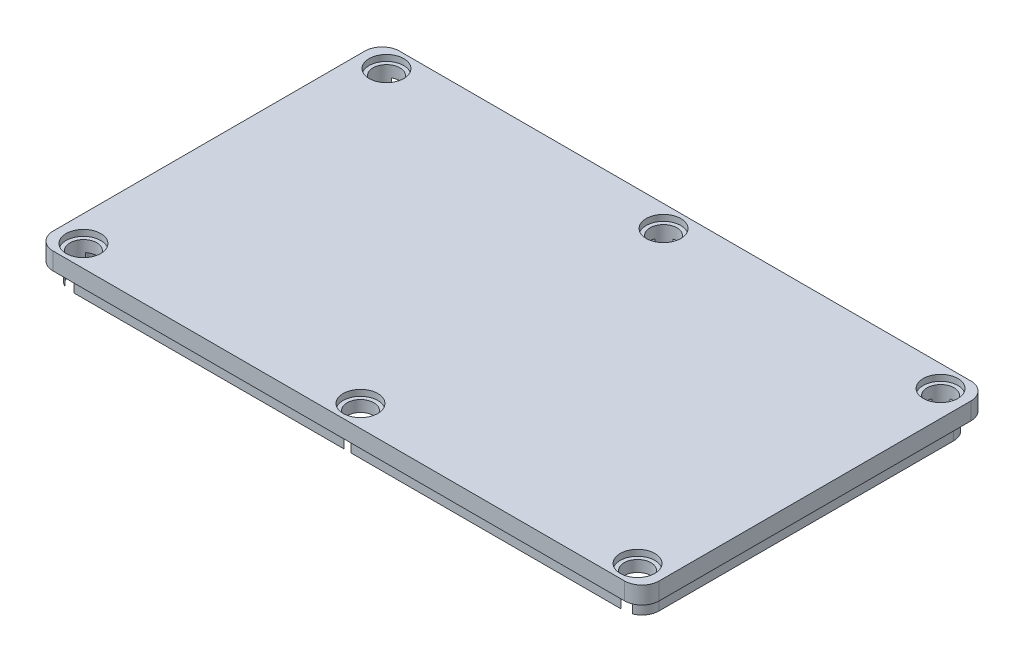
from build123d import *

# Parameters (mm, degrees)
BOSS_EXTRUDE1_DEPTH  = 2
BOSS_EXTRUDE2_DEPTH  = 2
SKETCH3_R            = 2
SKETCH3_R_2          = 1.5
CUT_EXTRUDE1_DEPTH   = 0.7
SKETCH8_R            = 1.55
CUT_EXTRUDE7_DEPTH   = 7
LPATTERN1_COUNT      = 3
LPATTERN1_PITCH      = 32
LPATTERN1_COUNT_DIR2 = 2
LPATTERN1_PITCH_DIR2 = 35


with BuildPart() as part:
    # Sketch1 → Boss-Extrude1 (new body)
    with BuildSketch(Plane(origin=(0, 0, 0), x_dir=(1, 0, 0), z_dir=(0, 1, 0))):
        with BuildLine():
            Line((-33, -20), (33, -20))
            ThreePointArc((33, -20), (34.414213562, -19.414213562), (35, -18))
            Line((35, -18), (35, 18))
            ThreePointArc((35, 18), (34.414213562, 19.414213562), (33, 20))
            Line((33, 20), (-33, 20))
            ThreePointArc((-33, 20), (-34.414213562, 19.414213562), (-35, 18))
            Line((-35, 18), (-35, -18))
            ThreePointArc((-35, -18), (-34.414213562, -19.414213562), (-33, -20))
        make_face()
    extrude(amount=BOSS_EXTRUDE1_DEPTH)

    # Sketch2 → Boss-Extrude2 (add)
    with BuildSketch(Plane.XZ):
        with BuildLine():
            Line((32, -19), (-32, -19))
            ThreePointArc((-32, -19), (-33.414213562, -18.414213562), (-34, -17))
            Line((-34, -17), (-34, 17))
            ThreePointArc((-34, 17), (-33.414213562, 18.414213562), (-32, 19))
            Line((-32, 19), (32, 19))
            ThreePointArc((32, 19), (33.414213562, 18.414213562), (34, 17))
            Line((34, 17), (34, -17))
            ThreePointArc((34, -17), (33.414213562, -18.414213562), (32, -19))
        make_face()
        with BuildLine():
            Line((31, -18), (-31, -18))
            ThreePointArc((-31, -18), (-32.414213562, -17.414213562), (-33, -16))
            Line((-33, -16), (-33, 16))
            ThreePointArc((-33, 16), (-32.414213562, 17.414213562), (-31, 18))
            Line((-31, 18), (31, 18))
            ThreePointArc((31, 18), (32.414213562, 17.414213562), (33, 16))
            Line((33, 16), (33, -16))
            ThreePointArc((33, -16), (32.414213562, -17.414213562), (31, -18))
        make_face(mode=Mode.SUBTRACT)
    extrude(amount=BOSS_EXTRUDE2_DEPTH)

    # Sketch3 → Cut-Extrude1 (cut)
    # profile 1 of 6: a face of its own
    with BuildSketch(Plane(origin=(0, 2, 0), x_dir=(1, 0, 0), z_dir=(0, 1, 0))):
        with Locations(Location((-32, 17.5, 0), (0, 0, 270))):
            Circle(SKETCH3_R)
        with Locations(Location((-32, 17.5, 0), (0, 0, 270))):
            Circle(SKETCH3_R_2, mode=Mode.SUBTRACT)
    # profile 2 of 6: a face of its own
    with BuildSketch(Plane(origin=(0, 2, 0), x_dir=(1, 0, 0), z_dir=(0, 1, 0))):
        with Locations(Location((0, 17.5, 0), (0, 0, 270))):
            Circle(SKETCH3_R)
        with Locations(Location((0, 17.5, 0), (0, 0, 270))):
            Circle(SKETCH3_R_2, mode=Mode.SUBTRACT)
    # profile 3 of 6: a face of its own
    with BuildSketch(Plane(origin=(0, 2, 0), x_dir=(1, 0, 0), z_dir=(0, 1, 0))):
        with Locations(Location((32, 17.5, 0), (0, 0, 270))):
            Circle(SKETCH3_R)
        with Locations(Location((32, 17.5, 0), (0, 0, 270))):
            Circle(SKETCH3_R_2, mode=Mode.SUBTRACT)
    # profile 4 of 6: a face of its own
    with BuildSketch(Plane(origin=(0, 2, 0), x_dir=(1, 0, 0), z_dir=(0, 1, 0))):
        with Locations(Location((32, -17.5, 0), (0, 0, 90))):
            Circle(SKETCH3_R)
        with Locations(Location((32, -17.5, 0), (0, 0, 270))):
            Circle(SKETCH3_R_2, mode=Mode.SUBTRACT)
    # profile 5 of 6: a face of its own
    with BuildSketch(Plane(origin=(0, 2, 0), x_dir=(1, 0, 0), z_dir=(0, 1, 0))):
        with Locations(Location((0, -17.5, 0), (0, 0, 90))):
            Circle(SKETCH3_R)
        with Locations(Location((0, -17.5, 0), (0, 0, 270))):
            Circle(SKETCH3_R_2, mode=Mode.SUBTRACT)
    # profile 6 of 6: a face of its own
    with BuildSketch(Plane(origin=(0, 2, 0), x_dir=(1, 0, 0), z_dir=(0, 1, 0))):
        with Locations(Location((-32, -17.5, 0), (0, 0, 90))):
            Circle(SKETCH3_R)
        with Locations(Location((-32, -17.5, 0), (0, 0, 270))):
            Circle(SKETCH3_R_2, mode=Mode.SUBTRACT)
    extrude(amount=-CUT_EXTRUDE1_DEPTH, mode=Mode.SUBTRACT)

    # Sketch8 → Cut-Extrude7 (cut)
    with BuildSketch(Plane(origin=(0, 2, 0), x_dir=(1, 0, 0), z_dir=(0, 1, 0))):
        with Locations(Location((-32, 17.5, 0), (0, 0, 270))):
            Circle(SKETCH8_R)
    cut_extrude7 = extrude(amount=-CUT_EXTRUDE7_DEPTH, mode=Mode.SUBTRACT)

    # LPattern1: Cut-Extrude7 3 × 2
    with Locations(*[(i * LPATTERN1_PITCH, 0, j * LPATTERN1_PITCH_DIR2) for i in range(LPATTERN1_COUNT) for j in range(LPATTERN1_COUNT_DIR2) if (i, j) != (0, 0)]):
        add(cut_extrude7, mode=Mode.SUBTRACT)


solid = part.part
